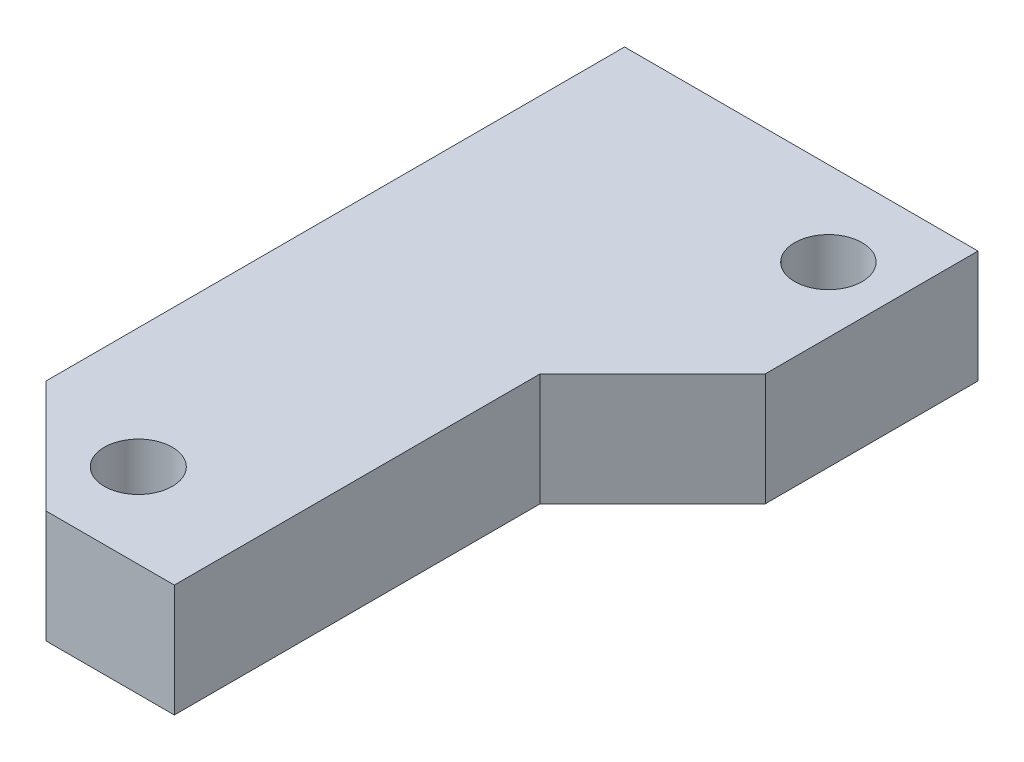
from build123d import *

# Parameters (mm, degrees)
SKETCH7_R           = 1.2
SKETCH7_R_2         = 1.207683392
BOSS_EXTRUDE5_DEPTH = 4


with BuildPart() as part:
    # Sketch7 → Boss-Extrude5 (new body)
    with BuildSketch(Plane(origin=(0, 0, 0), x_dir=(-1, 0, 0), z_dir=(0, 1, 0))):
        Polygon((-51.78, -11.28), (-39.22, -11.28), (-39.22, 9.28), (-43.22, 13.28), (-47.78, 13.28), (-47.78, 0.28), (-51.78, -3.72), align=None)
        with Locations(Location((-49.463385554, -8.28, 0), (0, 0, 90))):
            Circle(SKETCH7_R, mode=Mode.SUBTRACT)
        with Locations(Location((-43.5, 10.28, 0), (0, 0, 90))):
            Circle(SKETCH7_R_2, mode=Mode.SUBTRACT)
    extrude(amount=-BOSS_EXTRUDE5_DEPTH)


solid = part.part
